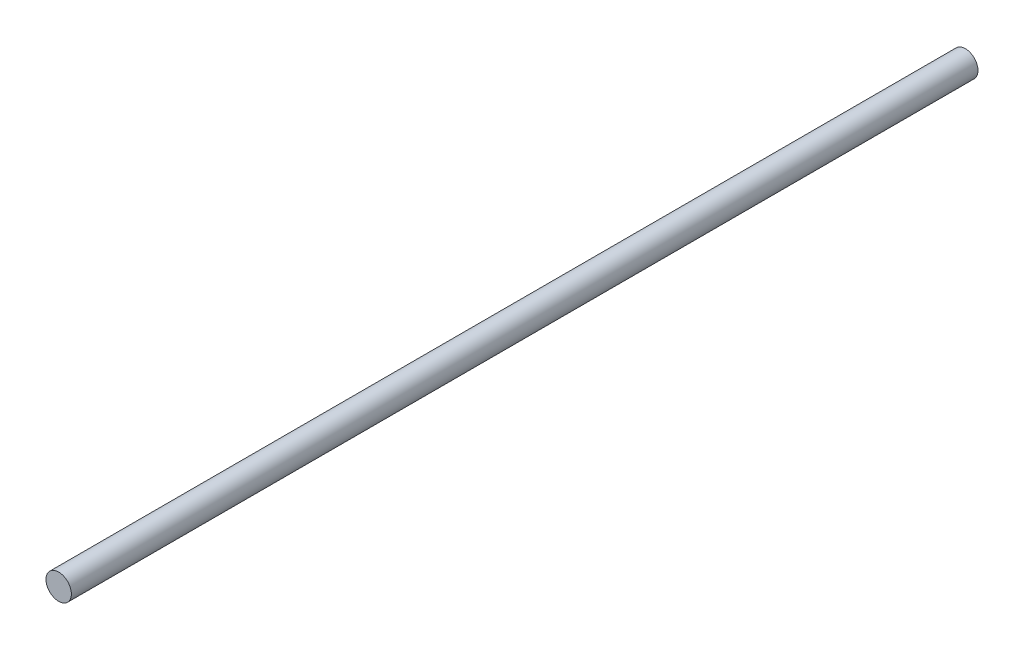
ISO-10303-21;
HEADER;
FILE_DESCRIPTION(('STEP AP214'),'2;1');
FILE_NAME('part.step','',(''),(''),'','','');
FILE_SCHEMA(('AUTOMOTIVE_DESIGN { 1 0 10303 214 1 1 1 1 }'));
ENDSEC;
DATA;
#1=APPLICATION_CONTEXT('core data for automotive mechanical design processes');
#2=APPLICATION_PROTOCOL_DEFINITION('international standard','automotive_design',2000,#1);
#3=PRODUCT_CONTEXT('',#1,'mechanical');
#4=PRODUCT('Part','Part','',(#3));
#5=PRODUCT_RELATED_PRODUCT_CATEGORY('part','',(#4));
#6=PRODUCT_DEFINITION_FORMATION('','',#4);
#7=PRODUCT_DEFINITION_CONTEXT('part definition',#1,'design');
#8=PRODUCT_DEFINITION('design','',#6,#7);
#9=PRODUCT_DEFINITION_SHAPE('','',#8);
#10=(LENGTH_UNIT() NAMED_UNIT(*) SI_UNIT(.MILLI.,.METRE.));
#11=(NAMED_UNIT(*) PLANE_ANGLE_UNIT() SI_UNIT($,.RADIAN.));
#12=(NAMED_UNIT(*) SI_UNIT($,.STERADIAN.) SOLID_ANGLE_UNIT());
#13=UNCERTAINTY_MEASURE_WITH_UNIT(LENGTH_MEASURE(1.E-05),#10,'distance_accuracy_value','');
#14=(GEOMETRIC_REPRESENTATION_CONTEXT(3) GLOBAL_UNCERTAINTY_ASSIGNED_CONTEXT((#13)) GLOBAL_UNIT_ASSIGNED_CONTEXT((#10,
#11,#12)) REPRESENTATION_CONTEXT('',''));
#15=CARTESIAN_POINT('',(0.,0.,0.));
#16=DIRECTION('',(0.,0.,1.));
#17=DIRECTION('',(1.,0.,0.));
#18=AXIS2_PLACEMENT_3D('',#15,#16,#17);
#19=CARTESIAN_POINT('',(0.,0.,50.));
#20=DIRECTION('',(0.,0.,-1.));
#21=DIRECTION('',(-1.,0.,0.));
#22=AXIS2_PLACEMENT_3D('',#19,#20,#21);
#23=CYLINDRICAL_SURFACE('',#22,1.4);
#24=CARTESIAN_POINT('',(0.,0.,50.));
#25=DIRECTION('',(0.,0.,1.));
#26=DIRECTION('',(1.,0.,0.));
#27=AXIS2_PLACEMENT_3D('',#24,#25,#26);
#28=CIRCLE('',#27,1.4);
#29=CARTESIAN_POINT('',(1.4,0.,50.));
#30=VERTEX_POINT('',#29);
#31=EDGE_CURVE('E10',#30,#30,#28,.T.);
#32=ORIENTED_EDGE('',*,*,#31,.F.);
#33=EDGE_LOOP('',(#32));
#34=FACE_BOUND('',#33,.T.);
#35=CARTESIAN_POINT('',(0.,0.,-50.));
#36=DIRECTION('',(0.,0.,1.));
#37=DIRECTION('',(1.,0.,0.));
#38=AXIS2_PLACEMENT_3D('',#35,#36,#37);
#39=CIRCLE('',#38,1.4);
#40=CARTESIAN_POINT('',(1.4,0.,-50.));
#41=VERTEX_POINT('',#40);
#42=EDGE_CURVE('E33',#41,#41,#39,.T.);
#43=ORIENTED_EDGE('',*,*,#42,.T.);
#44=EDGE_LOOP('',(#43));
#45=FACE_BOUND('',#44,.T.);
#46=ADVANCED_FACE('F30',(#34,#45),#23,.T.);
#47=CARTESIAN_POINT('',(0.,0.,50.));
#48=DIRECTION('',(0.,0.,1.));
#49=DIRECTION('',(1.,0.,0.));
#50=AXIS2_PLACEMENT_3D('',#47,#48,#49);
#51=PLANE('',#50);
#52=ORIENTED_EDGE('',*,*,#31,.T.);
#53=EDGE_LOOP('',(#52));
#54=FACE_BOUND('',#53,.T.);
#55=ADVANCED_FACE('F45',(#54),#51,.T.);
#56=CARTESIAN_POINT('',(0.,0.,-50.));
#57=DIRECTION('',(0.,0.,1.));
#58=DIRECTION('',(1.,0.,0.));
#59=AXIS2_PLACEMENT_3D('',#56,#57,#58);
#60=PLANE('',#59);
#61=ORIENTED_EDGE('',*,*,#42,.F.);
#62=EDGE_LOOP('',(#61));
#63=FACE_BOUND('',#62,.T.);
#64=ADVANCED_FACE('F43',(#63),#60,.F.);
#65=CLOSED_SHELL('',(#46,#55,#64));
#66=MANIFOLD_SOLID_BREP('B2',#65);
#67=ADVANCED_BREP_SHAPE_REPRESENTATION('',(#18,#66),#14);
#68=SHAPE_DEFINITION_REPRESENTATION(#9,#67);
ENDSEC;
END-ISO-10303-21;
